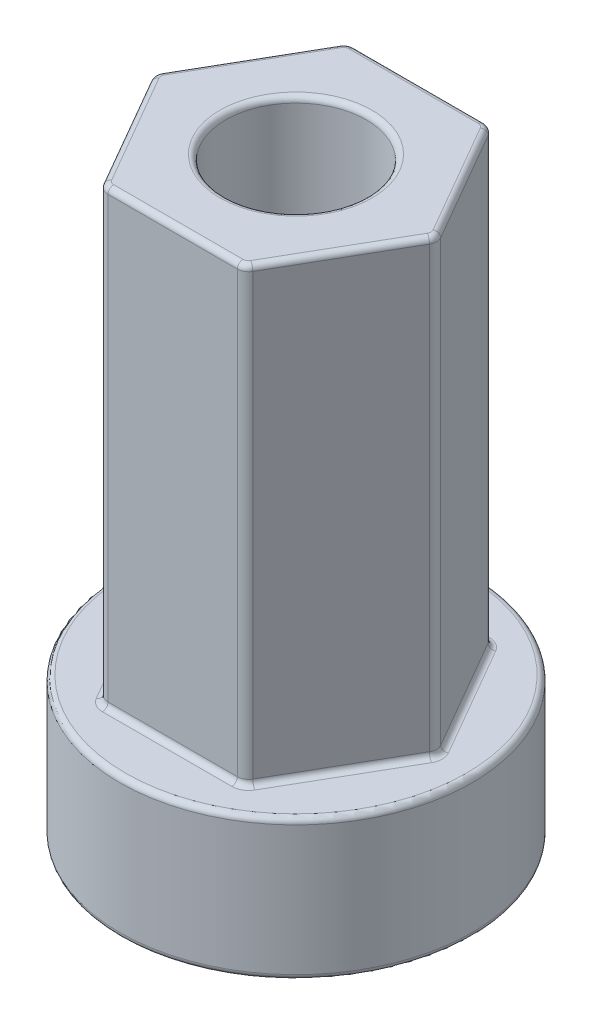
ISO-10303-21;
HEADER;
FILE_DESCRIPTION(('STEP AP214'),'2;1');
FILE_NAME('part.step','',(''),(''),'','','');
FILE_SCHEMA(('AUTOMOTIVE_DESIGN { 1 0 10303 214 1 1 1 1 }'));
ENDSEC;
DATA;
#1=APPLICATION_CONTEXT('core data for automotive mechanical design processes');
#2=APPLICATION_PROTOCOL_DEFINITION('international standard','automotive_design',2000,#1);
#3=PRODUCT_CONTEXT('',#1,'mechanical');
#4=PRODUCT('Part','Part','',(#3));
#5=PRODUCT_RELATED_PRODUCT_CATEGORY('part','',(#4));
#6=PRODUCT_DEFINITION_FORMATION('','',#4);
#7=PRODUCT_DEFINITION_CONTEXT('part definition',#1,'design');
#8=PRODUCT_DEFINITION('design','',#6,#7);
#9=PRODUCT_DEFINITION_SHAPE('','',#8);
#10=(LENGTH_UNIT() NAMED_UNIT(*) SI_UNIT(.MILLI.,.METRE.));
#11=(NAMED_UNIT(*) PLANE_ANGLE_UNIT() SI_UNIT($,.RADIAN.));
#12=(NAMED_UNIT(*) SI_UNIT($,.STERADIAN.) SOLID_ANGLE_UNIT());
#13=UNCERTAINTY_MEASURE_WITH_UNIT(LENGTH_MEASURE(1.E-05),#10,'distance_accuracy_value','');
#14=(GEOMETRIC_REPRESENTATION_CONTEXT(3) GLOBAL_UNCERTAINTY_ASSIGNED_CONTEXT((#13)) GLOBAL_UNIT_ASSIGNED_CONTEXT((#10,
#11,#12)) REPRESENTATION_CONTEXT('',''));
#15=CARTESIAN_POINT('',(0.,0.,0.));
#16=DIRECTION('',(0.,0.,1.));
#17=DIRECTION('',(1.,0.,0.));
#18=AXIS2_PLACEMENT_3D('',#15,#16,#17);
#19=CARTESIAN_POINT('',(0.,6.35,0.));
#20=DIRECTION('',(0.,1.,0.));
#21=DIRECTION('',(0.,0.,1.));
#22=AXIS2_PLACEMENT_3D('',#19,#20,#21);
#23=PLANE('',#22);
#24=DIRECTION('',(1.,0.,0.));
#25=VECTOR('',#24,1.);
#26=CARTESIAN_POINT('',(0.,6.35,5.81025));
#27=LINE('',#26,#25);
#28=CARTESIAN_POINT('',(2.91460849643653,6.35,5.81025));
#29=VERTEX_POINT('',#28);
#30=CARTESIAN_POINT('',(-2.91460849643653,6.35,5.81025));
#31=VERTEX_POINT('',#30);
#32=EDGE_CURVE('E34',#29,#31,#27,.F.);
#33=ORIENTED_EDGE('',*,*,#32,.T.);
#34=CARTESIAN_POINT('',(-2.91460849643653,6.35,5.04825));
#35=DIRECTION('',(0.,1.,0.));
#36=DIRECTION('',(0.,0.,1.));
#37=AXIS2_PLACEMENT_3D('',#34,#35,#36);
#38=CIRCLE('',#37,0.762);
#39=CARTESIAN_POINT('',(-3.57451985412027,6.35,5.42925));
#40=VERTEX_POINT('',#39);
#41=EDGE_CURVE('E11',#31,#40,#38,.F.);
#42=ORIENTED_EDGE('',*,*,#41,.T.);
#43=DIRECTION('',(0.5,0.,0.866025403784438));
#44=VECTOR('',#43,1.);
#45=CARTESIAN_POINT('',(-5.03182410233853,6.35,2.905125));
#46=LINE('',#45,#44);
#47=CARTESIAN_POINT('',(-6.4891283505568,6.35,0.381000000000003));
#48=VERTEX_POINT('',#47);
#49=EDGE_CURVE('E269',#40,#48,#46,.F.);
#50=ORIENTED_EDGE('',*,*,#49,.T.);
#51=CARTESIAN_POINT('',(-5.82921699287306,6.35,0.));
#52=DIRECTION('',(0.,1.,0.));
#53=DIRECTION('',(0.,0.,1.));
#54=AXIS2_PLACEMENT_3D('',#51,#52,#53);
#55=CIRCLE('',#54,0.762);
#56=CARTESIAN_POINT('',(-6.4891283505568,6.35,-0.380999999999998));
#57=VERTEX_POINT('',#56);
#58=EDGE_CURVE('E271',#48,#57,#55,.F.);
#59=ORIENTED_EDGE('',*,*,#58,.T.);
#60=DIRECTION('',(-0.5,0.,0.866025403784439));
#61=VECTOR('',#60,1.);
#62=CARTESIAN_POINT('',(-5.03182410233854,6.35,-2.905125));
#63=LINE('',#62,#61);
#64=CARTESIAN_POINT('',(-3.57451985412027,6.35,-5.42925));
#65=VERTEX_POINT('',#64);
#66=EDGE_CURVE('E273',#57,#65,#63,.F.);
#67=ORIENTED_EDGE('',*,*,#66,.T.);
#68=CARTESIAN_POINT('',(-2.91460849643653,6.35,-5.04825));
#69=DIRECTION('',(0.,1.,0.));
#70=DIRECTION('',(0.,0.,1.));
#71=AXIS2_PLACEMENT_3D('',#68,#69,#70);
#72=CIRCLE('',#71,0.762);
#73=CARTESIAN_POINT('',(-2.91460849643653,6.35,-5.81025));
#74=VERTEX_POINT('',#73);
#75=EDGE_CURVE('E275',#65,#74,#72,.F.);
#76=ORIENTED_EDGE('',*,*,#75,.T.);
#77=DIRECTION('',(-1.,0.,0.));
#78=VECTOR('',#77,1.);
#79=CARTESIAN_POINT('',(0.,6.35,-5.81025));
#80=LINE('',#79,#78);
#81=CARTESIAN_POINT('',(2.91460849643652,6.35,-5.81025));
#82=VERTEX_POINT('',#81);
#83=EDGE_CURVE('E277',#74,#82,#80,.F.);
#84=ORIENTED_EDGE('',*,*,#83,.T.);
#85=CARTESIAN_POINT('',(2.91460849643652,6.35,-5.04825));
#86=DIRECTION('',(0.,1.,0.));
#87=DIRECTION('',(0.,0.,1.));
#88=AXIS2_PLACEMENT_3D('',#85,#86,#87);
#89=CIRCLE('',#88,0.762);
#90=CARTESIAN_POINT('',(3.57451985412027,6.35,-5.42925));
#91=VERTEX_POINT('',#90);
#92=EDGE_CURVE('E279',#82,#91,#89,.F.);
#93=ORIENTED_EDGE('',*,*,#92,.T.);
#94=DIRECTION('',(-0.5,0.,-0.866025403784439));
#95=VECTOR('',#94,1.);
#96=CARTESIAN_POINT('',(5.03182410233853,6.35,-2.905125));
#97=LINE('',#96,#95);
#98=CARTESIAN_POINT('',(6.4891283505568,6.35,-0.381));
#99=VERTEX_POINT('',#98);
#100=EDGE_CURVE('E281',#91,#99,#97,.F.);
#101=ORIENTED_EDGE('',*,*,#100,.T.);
#102=CARTESIAN_POINT('',(5.82921699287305,6.35,0.));
#103=DIRECTION('',(0.,1.,0.));
#104=DIRECTION('',(0.,0.,1.));
#105=AXIS2_PLACEMENT_3D('',#102,#103,#104);
#106=CIRCLE('',#105,0.762);
#107=CARTESIAN_POINT('',(6.4891283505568,6.35,0.381));
#108=VERTEX_POINT('',#107);
#109=EDGE_CURVE('E283',#99,#108,#106,.F.);
#110=ORIENTED_EDGE('',*,*,#109,.T.);
#111=DIRECTION('',(0.5,0.,-0.866025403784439));
#112=VECTOR('',#111,1.);
#113=CARTESIAN_POINT('',(5.03182410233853,6.35,2.905125));
#114=LINE('',#113,#112);
#115=CARTESIAN_POINT('',(3.57451985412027,6.35,5.42925));
#116=VERTEX_POINT('',#115);
#117=EDGE_CURVE('E285',#108,#116,#114,.F.);
#118=ORIENTED_EDGE('',*,*,#117,.T.);
#119=CARTESIAN_POINT('',(2.91460849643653,6.35,5.04825));
#120=DIRECTION('',(0.,1.,0.));
#121=DIRECTION('',(0.,0.,1.));
#122=AXIS2_PLACEMENT_3D('',#119,#120,#121);
#123=CIRCLE('',#122,0.762);
#124=EDGE_CURVE('E44',#116,#29,#123,.F.);
#125=ORIENTED_EDGE('',*,*,#124,.T.);
#126=EDGE_LOOP('',(#33,#42,#50,#59,#67,#76,#84,#93,#101,#110,#118,#125));
#127=FACE_BOUND('',#126,.T.);
#128=CARTESIAN_POINT('',(0.,6.35,0.));
#129=DIRECTION('',(0.,1.,0.));
#130=DIRECTION('',(0.,0.,1.));
#131=AXIS2_PLACEMENT_3D('',#128,#129,#130);
#132=CIRCLE('',#131,7.6835);
#133=CARTESIAN_POINT('',(0.,6.35,7.6835));
#134=VERTEX_POINT('',#133);
#135=EDGE_CURVE('E266',#134,#134,#132,.T.);
#136=ORIENTED_EDGE('',*,*,#135,.T.);
#137=EDGE_LOOP('',(#136));
#138=FACE_BOUND('',#137,.T.);
#139=ADVANCED_FACE('F26',(#127,#138),#23,.T.);
#140=CARTESIAN_POINT('',(0.,6.35,0.));
#141=DIRECTION('',(0.,-1.,0.));
#142=DIRECTION('',(0.,0.,-1.));
#143=AXIS2_PLACEMENT_3D('',#140,#141,#142);
#144=CYLINDRICAL_SURFACE('',#143,7.9375);
#145=CARTESIAN_POINT('',(0.,0.254,0.));
#146=DIRECTION('',(0.,1.,0.));
#147=DIRECTION('',(0.,0.,1.));
#148=AXIS2_PLACEMENT_3D('',#145,#146,#147);
#149=CIRCLE('',#148,7.9375);
#150=CARTESIAN_POINT('',(0.,0.254,7.9375));
#151=VERTEX_POINT('',#150);
#152=EDGE_CURVE('E419',#151,#151,#149,.T.);
#153=ORIENTED_EDGE('',*,*,#152,.T.);
#154=EDGE_LOOP('',(#153));
#155=FACE_BOUND('',#154,.T.);
#156=CARTESIAN_POINT('',(0.,6.096,0.));
#157=DIRECTION('',(0.,1.,0.));
#158=DIRECTION('',(0.,0.,1.));
#159=AXIS2_PLACEMENT_3D('',#156,#157,#158);
#160=CIRCLE('',#159,7.9375);
#161=CARTESIAN_POINT('',(0.,6.096,7.9375));
#162=VERTEX_POINT('',#161);
#163=EDGE_CURVE('E416',#162,#162,#160,.F.);
#164=ORIENTED_EDGE('',*,*,#163,.T.);
#165=EDGE_LOOP('',(#164));
#166=FACE_BOUND('',#165,.T.);
#167=ADVANCED_FACE('F28',(#155,#166),#144,.T.);
#168=CARTESIAN_POINT('',(0.,0.,0.));
#169=DIRECTION('',(0.,1.,0.));
#170=DIRECTION('',(0.,0.,1.));
#171=AXIS2_PLACEMENT_3D('',#168,#169,#170);
#172=PLANE('',#171);
#173=CARTESIAN_POINT('',(0.,0.,0.));
#174=DIRECTION('',(0.,1.,0.));
#175=DIRECTION('',(0.,0.,1.));
#176=AXIS2_PLACEMENT_3D('',#173,#174,#175);
#177=CIRCLE('',#176,7.6835);
#178=CARTESIAN_POINT('',(0.,0.,7.6835));
#179=VERTEX_POINT('',#178);
#180=EDGE_CURVE('E425',#179,#179,#177,.F.);
#181=ORIENTED_EDGE('',*,*,#180,.T.);
#182=EDGE_LOOP('',(#181));
#183=FACE_BOUND('',#182,.T.);
#184=CARTESIAN_POINT('',(0.,0.,0.));
#185=DIRECTION('',(0.,1.,0.));
#186=DIRECTION('',(0.,0.,1.));
#187=AXIS2_PLACEMENT_3D('',#184,#185,#186);
#188=CIRCLE('',#187,3.429);
#189=CARTESIAN_POINT('',(0.,0.,3.429));
#190=VERTEX_POINT('',#189);
#191=EDGE_CURVE('E422',#190,#190,#188,.T.);
#192=ORIENTED_EDGE('',*,*,#191,.T.);
#193=EDGE_LOOP('',(#192));
#194=FACE_BOUND('',#193,.T.);
#195=ADVANCED_FACE('F572',(#183,#194),#172,.F.);
#196=CARTESIAN_POINT('',(-3.20790243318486,26.67,-5.55625));
#197=DIRECTION('',(0.866025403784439,0.,0.5));
#198=DIRECTION('',(0.5,0.,-0.866025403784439));
#199=AXIS2_PLACEMENT_3D('',#196,#197,#198);
#200=PLANE('',#199);
#201=DIRECTION('',(0.,-1.,0.));
#202=VECTOR('',#201,1.);
#203=CARTESIAN_POINT('',(-6.26915789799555,26.67,-0.253999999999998));
#204=LINE('',#203,#202);
#205=CARTESIAN_POINT('',(-6.26915789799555,6.604,-0.253999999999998));
#206=VERTEX_POINT('',#205);
#207=CARTESIAN_POINT('',(-6.26915789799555,26.416,-0.253999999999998));
#208=VERTEX_POINT('',#207);
#209=EDGE_CURVE('E380',#206,#208,#204,.F.);
#210=ORIENTED_EDGE('',*,*,#209,.T.);
#211=DIRECTION('',(-0.5,0.,0.866025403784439));
#212=VECTOR('',#211,1.);
#213=CARTESIAN_POINT('',(-3.35454940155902,26.416,-5.30225));
#214=LINE('',#213,#212);
#215=CARTESIAN_POINT('',(-3.35454940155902,26.416,-5.30225));
#216=VERTEX_POINT('',#215);
#217=EDGE_CURVE('E256',#208,#216,#214,.F.);
#218=ORIENTED_EDGE('',*,*,#217,.T.);
#219=DIRECTION('',(0.,-1.,0.));
#220=VECTOR('',#219,1.);
#221=CARTESIAN_POINT('',(-3.35454940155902,26.67,-5.30225));
#222=LINE('',#221,#220);
#223=CARTESIAN_POINT('',(-3.35454940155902,6.604,-5.30225));
#224=VERTEX_POINT('',#223);
#225=EDGE_CURVE('E383',#216,#224,#222,.T.);
#226=ORIENTED_EDGE('',*,*,#225,.T.);
#227=DIRECTION('',(-0.5,0.,0.866025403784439));
#228=VECTOR('',#227,1.);
#229=CARTESIAN_POINT('',(-3.20790243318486,6.604,-5.55625));
#230=LINE('',#229,#228);
#231=EDGE_CURVE('E254',#224,#206,#230,.T.);
#232=ORIENTED_EDGE('',*,*,#231,.T.);
#233=EDGE_LOOP('',(#210,#218,#226,#232));
#234=FACE_BOUND('',#233,.T.);
#235=ADVANCED_FACE('F535',(#234),#200,.F.);
#236=CARTESIAN_POINT('',(-6.41580486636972,26.67,0.));
#237=DIRECTION('',(0.866025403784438,0.,-0.5));
#238=DIRECTION('',(-0.5,0.,-0.866025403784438));
#239=AXIS2_PLACEMENT_3D('',#236,#237,#238);
#240=PLANE('',#239);
#241=DIRECTION('',(0.,-1.,0.));
#242=VECTOR('',#241,1.);
#243=CARTESIAN_POINT('',(-3.35454940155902,26.67,5.30225));
#244=LINE('',#243,#242);
#245=CARTESIAN_POINT('',(-3.35454940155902,6.604,5.30225));
#246=VERTEX_POINT('',#245);
#247=CARTESIAN_POINT('',(-3.35454940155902,26.416,5.30225));
#248=VERTEX_POINT('',#247);
#249=EDGE_CURVE('E413',#246,#248,#244,.F.);
#250=ORIENTED_EDGE('',*,*,#249,.T.);
#251=DIRECTION('',(0.5,0.,0.866025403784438));
#252=VECTOR('',#251,1.);
#253=CARTESIAN_POINT('',(-6.26915789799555,26.416,0.254000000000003));
#254=LINE('',#253,#252);
#255=CARTESIAN_POINT('',(-6.26915789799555,26.416,0.254000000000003));
#256=VERTEX_POINT('',#255);
#257=EDGE_CURVE('E248',#248,#256,#254,.F.);
#258=ORIENTED_EDGE('',*,*,#257,.T.);
#259=DIRECTION('',(0.,-1.,0.));
#260=VECTOR('',#259,1.);
#261=CARTESIAN_POINT('',(-6.26915789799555,26.67,0.254000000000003));
#262=LINE('',#261,#260);
#263=CARTESIAN_POINT('',(-6.26915789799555,6.604,0.254000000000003));
#264=VERTEX_POINT('',#263);
#265=EDGE_CURVE('E410',#256,#264,#262,.T.);
#266=ORIENTED_EDGE('',*,*,#265,.T.);
#267=DIRECTION('',(0.5,0.,0.866025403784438));
#268=VECTOR('',#267,1.);
#269=CARTESIAN_POINT('',(-6.41580486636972,6.604,0.));
#270=LINE('',#269,#268);
#271=EDGE_CURVE('E246',#264,#246,#270,.T.);
#272=ORIENTED_EDGE('',*,*,#271,.T.);
#273=EDGE_LOOP('',(#250,#258,#266,#272));
#274=FACE_BOUND('',#273,.T.);
#275=ADVANCED_FACE('F513',(#274),#240,.F.);
#276=CARTESIAN_POINT('',(-3.20790243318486,26.67,5.55625));
#277=DIRECTION('',(0.,0.,-1.));
#278=DIRECTION('',(-1.,0.,0.));
#279=AXIS2_PLACEMENT_3D('',#276,#277,#278);
#280=PLANE('',#279);
#281=DIRECTION('',(0.,-1.,0.));
#282=VECTOR('',#281,1.);
#283=CARTESIAN_POINT('',(2.91460849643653,26.67,5.55625));
#284=LINE('',#283,#282);
#285=CARTESIAN_POINT('',(2.91460849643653,6.604,5.55625));
#286=VERTEX_POINT('',#285);
#287=CARTESIAN_POINT('',(2.91460849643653,26.416,5.55625));
#288=VERTEX_POINT('',#287);
#289=EDGE_CURVE('E407',#286,#288,#284,.F.);
#290=ORIENTED_EDGE('',*,*,#289,.T.);
#291=DIRECTION('',(1.,0.,0.));
#292=VECTOR('',#291,1.);
#293=CARTESIAN_POINT('',(-2.91460849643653,26.416,5.55625));
#294=LINE('',#293,#292);
#295=CARTESIAN_POINT('',(-2.91460849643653,26.416,5.55625));
#296=VERTEX_POINT('',#295);
#297=EDGE_CURVE('E239',#288,#296,#294,.F.);
#298=ORIENTED_EDGE('',*,*,#297,.T.);
#299=DIRECTION('',(0.,-1.,0.));
#300=VECTOR('',#299,1.);
#301=CARTESIAN_POINT('',(-2.91460849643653,26.67,5.55625));
#302=LINE('',#301,#300);
#303=CARTESIAN_POINT('',(-2.91460849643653,6.604,5.55625));
#304=VERTEX_POINT('',#303);
#305=EDGE_CURVE('E404',#296,#304,#302,.T.);
#306=ORIENTED_EDGE('',*,*,#305,.T.);
#307=DIRECTION('',(1.,0.,0.));
#308=VECTOR('',#307,1.);
#309=CARTESIAN_POINT('',(-3.20790243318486,6.604,5.55625));
#310=LINE('',#309,#308);
#311=EDGE_CURVE('E237',#304,#286,#310,.T.);
#312=ORIENTED_EDGE('',*,*,#311,.T.);
#313=EDGE_LOOP('',(#290,#298,#306,#312));
#314=FACE_BOUND('',#313,.T.);
#315=ADVANCED_FACE('F497',(#314),#280,.F.);
#316=CARTESIAN_POINT('',(3.20790243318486,26.67,5.55625));
#317=DIRECTION('',(-0.866025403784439,0.,-0.5));
#318=DIRECTION('',(-0.5,0.,0.866025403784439));
#319=AXIS2_PLACEMENT_3D('',#316,#317,#318);
#320=PLANE('',#319);
#321=DIRECTION('',(0.,-1.,0.));
#322=VECTOR('',#321,1.);
#323=CARTESIAN_POINT('',(6.26915789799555,26.67,0.254));
#324=LINE('',#323,#322);
#325=CARTESIAN_POINT('',(6.26915789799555,6.604,0.254));
#326=VERTEX_POINT('',#325);
#327=CARTESIAN_POINT('',(6.26915789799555,26.416,0.254));
#328=VERTEX_POINT('',#327);
#329=EDGE_CURVE('E401',#326,#328,#324,.F.);
#330=ORIENTED_EDGE('',*,*,#329,.T.);
#331=DIRECTION('',(0.5,0.,-0.866025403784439));
#332=VECTOR('',#331,1.);
#333=CARTESIAN_POINT('',(3.35454940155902,26.416,5.30225));
#334=LINE('',#333,#332);
#335=CARTESIAN_POINT('',(3.35454940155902,26.416,5.30225));
#336=VERTEX_POINT('',#335);
#337=EDGE_CURVE('E231',#328,#336,#334,.F.);
#338=ORIENTED_EDGE('',*,*,#337,.T.);
#339=DIRECTION('',(0.,-1.,0.));
#340=VECTOR('',#339,1.);
#341=CARTESIAN_POINT('',(3.35454940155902,26.67,5.30225));
#342=LINE('',#341,#340);
#343=CARTESIAN_POINT('',(3.35454940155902,6.604,5.30225));
#344=VERTEX_POINT('',#343);
#345=EDGE_CURVE('E398',#336,#344,#342,.T.);
#346=ORIENTED_EDGE('',*,*,#345,.T.);
#347=DIRECTION('',(0.5,0.,-0.866025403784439));
#348=VECTOR('',#347,1.);
#349=CARTESIAN_POINT('',(3.20790243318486,6.604,5.55625));
#350=LINE('',#349,#348);
#351=EDGE_CURVE('E229',#344,#326,#350,.T.);
#352=ORIENTED_EDGE('',*,*,#351,.T.);
#353=EDGE_LOOP('',(#330,#338,#346,#352));
#354=FACE_BOUND('',#353,.T.);
#355=ADVANCED_FACE('F482',(#354),#320,.F.);
#356=CARTESIAN_POINT('',(6.41580486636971,26.67,0.));
#357=DIRECTION('',(-0.866025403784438,0.,0.5));
#358=DIRECTION('',(0.5,0.,0.866025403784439));
#359=AXIS2_PLACEMENT_3D('',#356,#357,#358);
#360=PLANE('',#359);
#361=DIRECTION('',(0.,-1.,0.));
#362=VECTOR('',#361,1.);
#363=CARTESIAN_POINT('',(3.35454940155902,26.67,-5.30225));
#364=LINE('',#363,#362);
#365=CARTESIAN_POINT('',(3.35454940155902,6.604,-5.30225));
#366=VERTEX_POINT('',#365);
#367=CARTESIAN_POINT('',(3.35454940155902,26.416,-5.30225));
#368=VERTEX_POINT('',#367);
#369=EDGE_CURVE('E395',#366,#368,#364,.F.);
#370=ORIENTED_EDGE('',*,*,#369,.T.);
#371=DIRECTION('',(-0.5,0.,-0.866025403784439));
#372=VECTOR('',#371,1.);
#373=CARTESIAN_POINT('',(6.26915789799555,26.416,-0.253999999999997));
#374=LINE('',#373,#372);
#375=CARTESIAN_POINT('',(6.26915789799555,26.416,-0.254));
#376=VERTEX_POINT('',#375);
#377=EDGE_CURVE('E223',#368,#376,#374,.F.);
#378=ORIENTED_EDGE('',*,*,#377,.T.);
#379=DIRECTION('',(0.,-1.,0.));
#380=VECTOR('',#379,1.);
#381=CARTESIAN_POINT('',(6.26915789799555,26.67,-0.254));
#382=LINE('',#381,#380);
#383=CARTESIAN_POINT('',(6.26915789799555,6.604,-0.254));
#384=VERTEX_POINT('',#383);
#385=EDGE_CURVE('E392',#376,#384,#382,.T.);
#386=ORIENTED_EDGE('',*,*,#385,.T.);
#387=DIRECTION('',(-0.5,0.,-0.866025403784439));
#388=VECTOR('',#387,1.);
#389=CARTESIAN_POINT('',(6.41580486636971,6.604,0.));
#390=LINE('',#389,#388);
#391=EDGE_CURVE('E221',#384,#366,#390,.T.);
#392=ORIENTED_EDGE('',*,*,#391,.T.);
#393=EDGE_LOOP('',(#370,#378,#386,#392));
#394=FACE_BOUND('',#393,.T.);
#395=ADVANCED_FACE('F467',(#394),#360,.F.);
#396=CARTESIAN_POINT('',(3.20790243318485,26.67,-5.55625));
#397=DIRECTION('',(0.,0.,1.));
#398=DIRECTION('',(1.,0.,0.));
#399=AXIS2_PLACEMENT_3D('',#396,#397,#398);
#400=PLANE('',#399);
#401=DIRECTION('',(0.,-1.,0.));
#402=VECTOR('',#401,1.);
#403=CARTESIAN_POINT('',(-2.91460849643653,26.67,-5.55625));
#404=LINE('',#403,#402);
#405=CARTESIAN_POINT('',(-2.91460849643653,6.604,-5.55625));
#406=VERTEX_POINT('',#405);
#407=CARTESIAN_POINT('',(-2.91460849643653,26.416,-5.55625));
#408=VERTEX_POINT('',#407);
#409=EDGE_CURVE('E389',#406,#408,#404,.F.);
#410=ORIENTED_EDGE('',*,*,#409,.T.);
#411=DIRECTION('',(-1.,0.,0.));
#412=VECTOR('',#411,1.);
#413=CARTESIAN_POINT('',(2.91460849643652,26.416,-5.55625));
#414=LINE('',#413,#412);
#415=CARTESIAN_POINT('',(2.91460849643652,26.416,-5.55625));
#416=VERTEX_POINT('',#415);
#417=EDGE_CURVE('E264',#408,#416,#414,.F.);
#418=ORIENTED_EDGE('',*,*,#417,.T.);
#419=DIRECTION('',(0.,-1.,0.));
#420=VECTOR('',#419,1.);
#421=CARTESIAN_POINT('',(2.91460849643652,26.67,-5.55625));
#422=LINE('',#421,#420);
#423=CARTESIAN_POINT('',(2.91460849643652,6.604,-5.55625));
#424=VERTEX_POINT('',#423);
#425=EDGE_CURVE('E386',#416,#424,#422,.T.);
#426=ORIENTED_EDGE('',*,*,#425,.T.);
#427=DIRECTION('',(-1.,0.,0.));
#428=VECTOR('',#427,1.);
#429=CARTESIAN_POINT('',(3.20790243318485,6.604,-5.55625));
#430=LINE('',#429,#428);
#431=EDGE_CURVE('E262',#424,#406,#430,.T.);
#432=ORIENTED_EDGE('',*,*,#431,.T.);
#433=EDGE_LOOP('',(#410,#418,#426,#432));
#434=FACE_BOUND('',#433,.T.);
#435=ADVANCED_FACE('F557',(#434),#400,.F.);
#436=CARTESIAN_POINT('',(-6.41580486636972,26.67,0.));
#437=DIRECTION('',(0.,1.,0.));
#438=DIRECTION('',(0.,0.,1.));
#439=AXIS2_PLACEMENT_3D('',#436,#437,#438);
#440=PLANE('',#439);
#441=DIRECTION('',(-0.5,0.,-0.866025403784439));
#442=VECTOR('',#441,1.);
#443=CARTESIAN_POINT('',(3.13457894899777,26.67,-5.17525));
#444=LINE('',#443,#442);
#445=CARTESIAN_POINT('',(6.0491874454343,26.67,-0.127));
#446=VERTEX_POINT('',#445);
#447=CARTESIAN_POINT('',(3.13457894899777,26.67,-5.17525));
#448=VERTEX_POINT('',#447);
#449=EDGE_CURVE('E211',#446,#448,#444,.T.);
#450=ORIENTED_EDGE('',*,*,#449,.T.);
#451=CARTESIAN_POINT('',(2.91460849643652,26.67,-5.04825));
#452=DIRECTION('',(0.,1.,0.));
#453=DIRECTION('',(0.,0.,1.));
#454=AXIS2_PLACEMENT_3D('',#451,#452,#453);
#455=CIRCLE('',#454,0.254);
#456=CARTESIAN_POINT('',(2.91460849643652,26.67,-5.30225));
#457=VERTEX_POINT('',#456);
#458=EDGE_CURVE('E190',#448,#457,#455,.T.);
#459=ORIENTED_EDGE('',*,*,#458,.T.);
#460=DIRECTION('',(-1.,0.,0.));
#461=VECTOR('',#460,1.);
#462=CARTESIAN_POINT('',(-2.91460849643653,26.67,-5.30225));
#463=LINE('',#462,#461);
#464=CARTESIAN_POINT('',(-2.91460849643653,26.67,-5.30225));
#465=VERTEX_POINT('',#464);
#466=EDGE_CURVE('E199',#457,#465,#463,.T.);
#467=ORIENTED_EDGE('',*,*,#466,.T.);
#468=CARTESIAN_POINT('',(-2.91460849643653,26.67,-5.04825));
#469=DIRECTION('',(0.,1.,0.));
#470=DIRECTION('',(0.,0.,1.));
#471=AXIS2_PLACEMENT_3D('',#468,#469,#470);
#472=CIRCLE('',#471,0.254);
#473=CARTESIAN_POINT('',(-3.13457894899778,26.67,-5.17525));
#474=VERTEX_POINT('',#473);
#475=EDGE_CURVE('E205',#465,#474,#472,.T.);
#476=ORIENTED_EDGE('',*,*,#475,.T.);
#477=DIRECTION('',(-0.5,0.,0.866025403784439));
#478=VECTOR('',#477,1.);
#479=CARTESIAN_POINT('',(-6.04918744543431,26.67,-0.126999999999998));
#480=LINE('',#479,#478);
#481=CARTESIAN_POINT('',(-6.04918744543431,26.67,-0.126999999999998));
#482=VERTEX_POINT('',#481);
#483=EDGE_CURVE('E437',#474,#482,#480,.T.);
#484=ORIENTED_EDGE('',*,*,#483,.T.);
#485=CARTESIAN_POINT('',(-5.82921699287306,26.67,0.));
#486=DIRECTION('',(0.,1.,0.));
#487=DIRECTION('',(0.,0.,1.));
#488=AXIS2_PLACEMENT_3D('',#485,#486,#487);
#489=CIRCLE('',#488,0.254);
#490=CARTESIAN_POINT('',(-6.0491874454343,26.67,0.127000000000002));
#491=VERTEX_POINT('',#490);
#492=EDGE_CURVE('E439',#482,#491,#489,.T.);
#493=ORIENTED_EDGE('',*,*,#492,.T.);
#494=DIRECTION('',(0.5,0.,0.866025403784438));
#495=VECTOR('',#494,1.);
#496=CARTESIAN_POINT('',(-3.13457894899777,26.67,5.17525));
#497=LINE('',#496,#495);
#498=CARTESIAN_POINT('',(-3.13457894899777,26.67,5.17525));
#499=VERTEX_POINT('',#498);
#500=EDGE_CURVE('E441',#491,#499,#497,.T.);
#501=ORIENTED_EDGE('',*,*,#500,.T.);
#502=CARTESIAN_POINT('',(-2.91460849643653,26.67,5.04825));
#503=DIRECTION('',(0.,1.,0.));
#504=DIRECTION('',(0.,0.,1.));
#505=AXIS2_PLACEMENT_3D('',#502,#503,#504);
#506=CIRCLE('',#505,0.254);
#507=CARTESIAN_POINT('',(-2.91460849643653,26.67,5.30225));
#508=VERTEX_POINT('',#507);
#509=EDGE_CURVE('E443',#499,#508,#506,.T.);
#510=ORIENTED_EDGE('',*,*,#509,.T.);
#511=DIRECTION('',(1.,0.,0.));
#512=VECTOR('',#511,1.);
#513=CARTESIAN_POINT('',(2.91460849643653,26.67,5.30225));
#514=LINE('',#513,#512);
#515=CARTESIAN_POINT('',(2.91460849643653,26.67,5.30225));
#516=VERTEX_POINT('',#515);
#517=EDGE_CURVE('E445',#508,#516,#514,.T.);
#518=ORIENTED_EDGE('',*,*,#517,.T.);
#519=CARTESIAN_POINT('',(2.91460849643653,26.67,5.04825));
#520=DIRECTION('',(0.,1.,0.));
#521=DIRECTION('',(0.,0.,1.));
#522=AXIS2_PLACEMENT_3D('',#519,#520,#521);
#523=CIRCLE('',#522,0.254);
#524=CARTESIAN_POINT('',(3.13457894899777,26.67,5.17525));
#525=VERTEX_POINT('',#524);
#526=EDGE_CURVE('E447',#516,#525,#523,.T.);
#527=ORIENTED_EDGE('',*,*,#526,.T.);
#528=DIRECTION('',(0.5,0.,-0.866025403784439));
#529=VECTOR('',#528,1.);
#530=CARTESIAN_POINT('',(6.0491874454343,26.67,0.126999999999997));
#531=LINE('',#530,#529);
#532=CARTESIAN_POINT('',(6.0491874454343,26.67,0.126999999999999));
#533=VERTEX_POINT('',#532);
#534=EDGE_CURVE('E449',#525,#533,#531,.T.);
#535=ORIENTED_EDGE('',*,*,#534,.T.);
#536=CARTESIAN_POINT('',(5.82921699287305,26.67,0.));
#537=DIRECTION('',(0.,1.,0.));
#538=DIRECTION('',(0.,0.,1.));
#539=AXIS2_PLACEMENT_3D('',#536,#537,#538);
#540=CIRCLE('',#539,0.254);
#541=EDGE_CURVE('E216',#533,#446,#540,.T.);
#542=ORIENTED_EDGE('',*,*,#541,.T.);
#543=EDGE_LOOP('',(#450,#459,#467,#476,#484,#493,#501,#510,#518,#527,#535,#542));
#544=FACE_BOUND('',#543,.T.);
#545=CARTESIAN_POINT('',(0.,26.67,0.));
#546=DIRECTION('',(0.,1.,0.));
#547=DIRECTION('',(0.,0.,1.));
#548=AXIS2_PLACEMENT_3D('',#545,#546,#547);
#549=CIRCLE('',#548,3.429);
#550=CARTESIAN_POINT('',(0.,26.67,3.429));
#551=VERTEX_POINT('',#550);
#552=EDGE_CURVE('E206',#551,#551,#549,.F.);
#553=ORIENTED_EDGE('',*,*,#552,.T.);
#554=EDGE_LOOP('',(#553));
#555=FACE_BOUND('',#554,.T.);
#556=ADVANCED_FACE('F208',(#544,#555),#440,.T.);
#557=CARTESIAN_POINT('',(0.,0.,0.));
#558=DIRECTION('',(0.,1.,0.));
#559=DIRECTION('',(0.,0.,1.));
#560=AXIS2_PLACEMENT_3D('',#557,#558,#559);
#561=CYLINDRICAL_SURFACE('',#560,3.175);
#562=CARTESIAN_POINT('',(0.,0.254,0.));
#563=DIRECTION('',(0.,1.,0.));
#564=DIRECTION('',(0.,0.,1.));
#565=AXIS2_PLACEMENT_3D('',#562,#563,#564);
#566=CIRCLE('',#565,3.175);
#567=CARTESIAN_POINT('',(0.,0.254,3.175));
#568=VERTEX_POINT('',#567);
#569=EDGE_CURVE('E431',#568,#568,#566,.F.);
#570=ORIENTED_EDGE('',*,*,#569,.T.);
#571=EDGE_LOOP('',(#570));
#572=FACE_BOUND('',#571,.T.);
#573=CARTESIAN_POINT('',(0.,26.416,0.));
#574=DIRECTION('',(0.,1.,0.));
#575=DIRECTION('',(0.,0.,1.));
#576=AXIS2_PLACEMENT_3D('',#573,#574,#575);
#577=CIRCLE('',#576,3.175);
#578=CARTESIAN_POINT('',(0.,26.416,3.175));
#579=VERTEX_POINT('',#578);
#580=EDGE_CURVE('E428',#579,#579,#577,.T.);
#581=ORIENTED_EDGE('',*,*,#580,.T.);
#582=EDGE_LOOP('',(#581));
#583=FACE_BOUND('',#582,.T.);
#584=ADVANCED_FACE('F592',(#572,#583),#561,.F.);
#585=CARTESIAN_POINT('',(-2.91460849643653,26.67,-5.04825));
#586=DIRECTION('',(0.,-1.,0.));
#587=DIRECTION('',(0.,0.,-1.));
#588=AXIS2_PLACEMENT_3D('',#585,#586,#587);
#589=CYLINDRICAL_SURFACE('',#588,0.508);
#590=ORIENTED_EDGE('',*,*,#225,.F.);
#591=CARTESIAN_POINT('',(-2.91460849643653,26.416,-5.04825));
#592=DIRECTION('',(0.,1.,0.));
#593=DIRECTION('',(0.,0.,1.));
#594=AXIS2_PLACEMENT_3D('',#591,#592,#593);
#595=CIRCLE('',#594,0.508);
#596=EDGE_CURVE('E260',#216,#408,#595,.F.);
#597=ORIENTED_EDGE('',*,*,#596,.T.);
#598=ORIENTED_EDGE('',*,*,#409,.F.);
#599=CARTESIAN_POINT('',(-2.91460849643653,6.604,-5.04825));
#600=DIRECTION('',(0.,1.,0.));
#601=DIRECTION('',(0.,0.,1.));
#602=AXIS2_PLACEMENT_3D('',#599,#600,#601);
#603=CIRCLE('',#602,0.508);
#604=EDGE_CURVE('E258',#406,#224,#603,.T.);
#605=ORIENTED_EDGE('',*,*,#604,.T.);
#606=EDGE_LOOP('',(#590,#597,#598,#605));
#607=FACE_BOUND('',#606,.T.);
#608=ADVANCED_FACE('F538',(#607),#589,.T.);
#609=CARTESIAN_POINT('',(2.91460849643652,26.67,-5.04825));
#610=DIRECTION('',(0.,-1.,0.));
#611=DIRECTION('',(0.,0.,-1.));
#612=AXIS2_PLACEMENT_3D('',#609,#610,#611);
#613=CYLINDRICAL_SURFACE('',#612,0.508);
#614=ORIENTED_EDGE('',*,*,#425,.F.);
#615=CARTESIAN_POINT('',(2.91460849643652,26.416,-5.04825));
#616=DIRECTION('',(0.,1.,0.));
#617=DIRECTION('',(0.,0.,1.));
#618=AXIS2_PLACEMENT_3D('',#615,#616,#617);
#619=CIRCLE('',#618,0.508);
#620=EDGE_CURVE('E192',#416,#368,#619,.F.);
#621=ORIENTED_EDGE('',*,*,#620,.T.);
#622=ORIENTED_EDGE('',*,*,#369,.F.);
#623=CARTESIAN_POINT('',(2.91460849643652,6.604,-5.04825));
#624=DIRECTION('',(0.,1.,0.));
#625=DIRECTION('',(0.,0.,1.));
#626=AXIS2_PLACEMENT_3D('',#623,#624,#625);
#627=CIRCLE('',#626,0.508);
#628=EDGE_CURVE('E213',#366,#424,#627,.T.);
#629=ORIENTED_EDGE('',*,*,#628,.T.);
#630=EDGE_LOOP('',(#614,#621,#622,#629));
#631=FACE_BOUND('',#630,.T.);
#632=ADVANCED_FACE('F465',(#631),#613,.T.);
#633=CARTESIAN_POINT('',(5.82921699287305,26.67,0.));
#634=DIRECTION('',(0.,-1.,0.));
#635=DIRECTION('',(0.,0.,-1.));
#636=AXIS2_PLACEMENT_3D('',#633,#634,#635);
#637=CYLINDRICAL_SURFACE('',#636,0.508);
#638=ORIENTED_EDGE('',*,*,#385,.F.);
#639=CARTESIAN_POINT('',(5.82921699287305,26.416,0.));
#640=DIRECTION('',(0.,1.,0.));
#641=DIRECTION('',(0.,0.,1.));
#642=AXIS2_PLACEMENT_3D('',#639,#640,#641);
#643=CIRCLE('',#642,0.508);
#644=EDGE_CURVE('E227',#376,#328,#643,.F.);
#645=ORIENTED_EDGE('',*,*,#644,.T.);
#646=ORIENTED_EDGE('',*,*,#329,.F.);
#647=CARTESIAN_POINT('',(5.82921699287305,6.604,0.));
#648=DIRECTION('',(0.,1.,0.));
#649=DIRECTION('',(0.,0.,1.));
#650=AXIS2_PLACEMENT_3D('',#647,#648,#649);
#651=CIRCLE('',#650,0.508);
#652=EDGE_CURVE('E225',#326,#384,#651,.T.);
#653=ORIENTED_EDGE('',*,*,#652,.T.);
#654=EDGE_LOOP('',(#638,#645,#646,#653));
#655=FACE_BOUND('',#654,.T.);
#656=ADVANCED_FACE('F479',(#655),#637,.T.);
#657=CARTESIAN_POINT('',(2.91460849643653,26.67,5.04825));
#658=DIRECTION('',(0.,-1.,0.));
#659=DIRECTION('',(0.,0.,-1.));
#660=AXIS2_PLACEMENT_3D('',#657,#658,#659);
#661=CYLINDRICAL_SURFACE('',#660,0.508);
#662=ORIENTED_EDGE('',*,*,#345,.F.);
#663=CARTESIAN_POINT('',(2.91460849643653,26.416,5.04825));
#664=DIRECTION('',(0.,1.,0.));
#665=DIRECTION('',(0.,0.,1.));
#666=AXIS2_PLACEMENT_3D('',#663,#664,#665);
#667=CIRCLE('',#666,0.508);
#668=EDGE_CURVE('E235',#336,#288,#667,.F.);
#669=ORIENTED_EDGE('',*,*,#668,.T.);
#670=ORIENTED_EDGE('',*,*,#289,.F.);
#671=CARTESIAN_POINT('',(2.91460849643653,6.604,5.04825));
#672=DIRECTION('',(0.,1.,0.));
#673=DIRECTION('',(0.,0.,1.));
#674=AXIS2_PLACEMENT_3D('',#671,#672,#673);
#675=CIRCLE('',#674,0.508);
#676=EDGE_CURVE('E233',#286,#344,#675,.T.);
#677=ORIENTED_EDGE('',*,*,#676,.T.);
#678=EDGE_LOOP('',(#662,#669,#670,#677));
#679=FACE_BOUND('',#678,.T.);
#680=ADVANCED_FACE('F494',(#679),#661,.T.);
#681=CARTESIAN_POINT('',(-2.91460849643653,26.67,5.04825));
#682=DIRECTION('',(0.,-1.,0.));
#683=DIRECTION('',(0.,0.,-1.));
#684=AXIS2_PLACEMENT_3D('',#681,#682,#683);
#685=CYLINDRICAL_SURFACE('',#684,0.508);
#686=ORIENTED_EDGE('',*,*,#305,.F.);
#687=CARTESIAN_POINT('',(-2.91460849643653,26.416,5.04825));
#688=DIRECTION('',(0.,1.,0.));
#689=DIRECTION('',(0.,0.,1.));
#690=AXIS2_PLACEMENT_3D('',#687,#688,#689);
#691=CIRCLE('',#690,0.508);
#692=EDGE_CURVE('E244',#296,#248,#691,.F.);
#693=ORIENTED_EDGE('',*,*,#692,.T.);
#694=ORIENTED_EDGE('',*,*,#249,.F.);
#695=CARTESIAN_POINT('',(-2.91460849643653,6.604,5.04825));
#696=DIRECTION('',(0.,1.,0.));
#697=DIRECTION('',(0.,0.,1.));
#698=AXIS2_PLACEMENT_3D('',#695,#696,#697);
#699=CIRCLE('',#698,0.508);
#700=EDGE_CURVE('E241',#246,#304,#699,.T.);
#701=ORIENTED_EDGE('',*,*,#700,.T.);
#702=EDGE_LOOP('',(#686,#693,#694,#701));
#703=FACE_BOUND('',#702,.T.);
#704=ADVANCED_FACE('F511',(#703),#685,.T.);
#705=CARTESIAN_POINT('',(-5.82921699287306,26.67,0.));
#706=DIRECTION('',(0.,-1.,0.));
#707=DIRECTION('',(0.,0.,-1.));
#708=AXIS2_PLACEMENT_3D('',#705,#706,#707);
#709=CYLINDRICAL_SURFACE('',#708,0.508);
#710=ORIENTED_EDGE('',*,*,#265,.F.);
#711=CARTESIAN_POINT('',(-5.82921699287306,26.416,0.));
#712=DIRECTION('',(0.,1.,0.));
#713=DIRECTION('',(0.,0.,1.));
#714=AXIS2_PLACEMENT_3D('',#711,#712,#713);
#715=CIRCLE('',#714,0.508);
#716=EDGE_CURVE('E252',#256,#208,#715,.F.);
#717=ORIENTED_EDGE('',*,*,#716,.T.);
#718=ORIENTED_EDGE('',*,*,#209,.F.);
#719=CARTESIAN_POINT('',(-5.82921699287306,6.604,0.));
#720=DIRECTION('',(0.,1.,0.));
#721=DIRECTION('',(0.,0.,1.));
#722=AXIS2_PLACEMENT_3D('',#719,#720,#721);
#723=CIRCLE('',#722,0.508);
#724=EDGE_CURVE('E250',#206,#264,#723,.T.);
#725=ORIENTED_EDGE('',*,*,#724,.T.);
#726=EDGE_LOOP('',(#710,#717,#718,#725));
#727=FACE_BOUND('',#726,.T.);
#728=ADVANCED_FACE('F517',(#727),#709,.T.);
#729=CARTESIAN_POINT('',(0.,0.254,0.));
#730=DIRECTION('',(0.,1.,0.));
#731=DIRECTION('',(0.,0.,1.));
#732=AXIS2_PLACEMENT_3D('',#729,#730,#731);
#733=TOROIDAL_SURFACE('',#732,7.6835,0.254);
#734=ORIENTED_EDGE('',*,*,#180,.F.);
#735=EDGE_LOOP('',(#734));
#736=FACE_BOUND('',#735,.T.);
#737=ORIENTED_EDGE('',*,*,#152,.F.);
#738=EDGE_LOOP('',(#737));
#739=FACE_BOUND('',#738,.T.);
#740=ADVANCED_FACE('F608',(#736,#739),#733,.T.);
#741=CARTESIAN_POINT('',(0.,0.254,0.));
#742=DIRECTION('',(0.,1.,0.));
#743=DIRECTION('',(0.,0.,1.));
#744=AXIS2_PLACEMENT_3D('',#741,#742,#743);
#745=TOROIDAL_SURFACE('',#744,3.429,0.254);
#746=ORIENTED_EDGE('',*,*,#569,.F.);
#747=EDGE_LOOP('',(#746));
#748=FACE_BOUND('',#747,.T.);
#749=ORIENTED_EDGE('',*,*,#191,.F.);
#750=EDGE_LOOP('',(#749));
#751=FACE_BOUND('',#750,.T.);
#752=ADVANCED_FACE('F611',(#748,#751),#745,.T.);
#753=CARTESIAN_POINT('',(-2.91460849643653,26.416,5.04825));
#754=DIRECTION('',(0.,1.,0.));
#755=DIRECTION('',(0.,0.,1.));
#756=AXIS2_PLACEMENT_3D('',#753,#754,#755);
#757=DEGENERATE_TOROIDAL_SURFACE('',#756,0.254,0.254,.T.);
#758=CARTESIAN_POINT('',(-3.13457894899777,26.416,5.17525));
#759=DIRECTION('',(-0.500000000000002,0.,-0.866025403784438));
#760=DIRECTION('',(-0.866025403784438,0.,0.500000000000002));
#761=AXIS2_PLACEMENT_3D('',#758,#759,#760);
#762=CIRCLE('',#761,0.254);
#763=EDGE_CURVE('E374',#248,#499,#762,.T.);
#764=ORIENTED_EDGE('',*,*,#763,.F.);
#765=ORIENTED_EDGE('',*,*,#692,.F.);
#766=CARTESIAN_POINT('',(-2.91460849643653,26.416,5.30225));
#767=DIRECTION('',(1.,0.,0.));
#768=DIRECTION('',(0.,0.,-1.));
#769=AXIS2_PLACEMENT_3D('',#766,#767,#768);
#770=CIRCLE('',#769,0.254);
#771=EDGE_CURVE('E377',#508,#296,#770,.T.);
#772=ORIENTED_EDGE('',*,*,#771,.F.);
#773=ORIENTED_EDGE('',*,*,#509,.F.);
#774=EDGE_LOOP('',(#764,#765,#772,#773));
#775=FACE_BOUND('',#774,.T.);
#776=ADVANCED_FACE('F507',(#775),#757,.T.);
#777=CARTESIAN_POINT('',(-6.41580486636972,26.416,5.30225));
#778=DIRECTION('',(-1.,0.,0.));
#779=DIRECTION('',(0.,0.,1.));
#780=AXIS2_PLACEMENT_3D('',#777,#778,#779);
#781=CYLINDRICAL_SURFACE('',#780,0.254);
#782=ORIENTED_EDGE('',*,*,#771,.T.);
#783=ORIENTED_EDGE('',*,*,#297,.F.);
#784=CARTESIAN_POINT('',(2.91460849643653,26.416,5.30225));
#785=DIRECTION('',(1.,0.,0.));
#786=DIRECTION('',(0.,0.,-1.));
#787=AXIS2_PLACEMENT_3D('',#784,#785,#786);
#788=CIRCLE('',#787,0.254);
#789=EDGE_CURVE('E371',#516,#288,#788,.T.);
#790=ORIENTED_EDGE('',*,*,#789,.F.);
#791=ORIENTED_EDGE('',*,*,#517,.F.);
#792=EDGE_LOOP('',(#782,#783,#790,#791));
#793=FACE_BOUND('',#792,.T.);
#794=ADVANCED_FACE('F500',(#793),#781,.T.);
#795=CARTESIAN_POINT('',(-6.19583441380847,26.416,-0.126999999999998));
#796=DIRECTION('',(-0.5,0.,-0.866025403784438));
#797=DIRECTION('',(-0.866025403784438,0.,0.5));
#798=AXIS2_PLACEMENT_3D('',#795,#796,#797);
#799=CYLINDRICAL_SURFACE('',#798,0.254);
#800=ORIENTED_EDGE('',*,*,#763,.T.);
#801=ORIENTED_EDGE('',*,*,#500,.F.);
#802=CARTESIAN_POINT('',(-6.04918744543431,26.416,0.127000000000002));
#803=DIRECTION('',(-0.500000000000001,0.,-0.866025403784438));
#804=DIRECTION('',(-0.866025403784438,0.,0.500000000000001));
#805=AXIS2_PLACEMENT_3D('',#802,#803,#804);
#806=CIRCLE('',#805,0.254);
#807=EDGE_CURVE('E368',#256,#491,#806,.T.);
#808=ORIENTED_EDGE('',*,*,#807,.F.);
#809=ORIENTED_EDGE('',*,*,#257,.F.);
#810=EDGE_LOOP('',(#800,#801,#808,#809));
#811=FACE_BOUND('',#810,.T.);
#812=ADVANCED_FACE('F522',(#811),#799,.T.);
#813=CARTESIAN_POINT('',(2.91460849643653,26.416,5.04825));
#814=DIRECTION('',(0.,1.,0.));
#815=DIRECTION('',(0.,0.,1.));
#816=AXIS2_PLACEMENT_3D('',#813,#814,#815);
#817=DEGENERATE_TOROIDAL_SURFACE('',#816,0.254,0.254,.T.);
#818=ORIENTED_EDGE('',*,*,#789,.T.);
#819=ORIENTED_EDGE('',*,*,#668,.F.);
#820=CARTESIAN_POINT('',(3.13457894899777,26.416,5.17525));
#821=DIRECTION('',(0.500000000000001,0.,-0.866025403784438));
#822=DIRECTION('',(-0.866025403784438,0.,-0.500000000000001));
#823=AXIS2_PLACEMENT_3D('',#820,#821,#822);
#824=CIRCLE('',#823,0.254);
#825=EDGE_CURVE('E365',#525,#336,#824,.T.);
#826=ORIENTED_EDGE('',*,*,#825,.F.);
#827=ORIENTED_EDGE('',*,*,#526,.F.);
#828=EDGE_LOOP('',(#818,#819,#826,#827));
#829=FACE_BOUND('',#828,.T.);
#830=ADVANCED_FACE('F490',(#829),#817,.T.);
#831=CARTESIAN_POINT('',(-5.82921699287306,26.416,0.));
#832=DIRECTION('',(0.,1.,0.));
#833=DIRECTION('',(0.,0.,1.));
#834=AXIS2_PLACEMENT_3D('',#831,#832,#833);
#835=DEGENERATE_TOROIDAL_SURFACE('',#834,0.254,0.254,.T.);
#836=ORIENTED_EDGE('',*,*,#807,.T.);
#837=ORIENTED_EDGE('',*,*,#492,.F.);
#838=CARTESIAN_POINT('',(-6.04918744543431,26.416,-0.126999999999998));
#839=DIRECTION('',(0.5,0.,-0.866025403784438));
#840=DIRECTION('',(-0.866025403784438,0.,-0.5));
#841=AXIS2_PLACEMENT_3D('',#838,#839,#840);
#842=CIRCLE('',#841,0.254);
#843=EDGE_CURVE('E362',#208,#482,#842,.T.);
#844=ORIENTED_EDGE('',*,*,#843,.F.);
#845=ORIENTED_EDGE('',*,*,#716,.F.);
#846=EDGE_LOOP('',(#836,#837,#844,#845));
#847=FACE_BOUND('',#846,.T.);
#848=ADVANCED_FACE('F526',(#847),#835,.T.);
#849=CARTESIAN_POINT('',(2.98793198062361,26.416,5.42925));
#850=DIRECTION('',(-0.5,0.,0.866025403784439));
#851=DIRECTION('',(0.866025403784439,0.,0.5));
#852=AXIS2_PLACEMENT_3D('',#849,#850,#851);
#853=CYLINDRICAL_SURFACE('',#852,0.254);
#854=ORIENTED_EDGE('',*,*,#825,.T.);
#855=ORIENTED_EDGE('',*,*,#337,.F.);
#856=CARTESIAN_POINT('',(6.0491874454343,26.416,0.126999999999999));
#857=DIRECTION('',(0.500000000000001,0.,-0.866025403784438));
#858=DIRECTION('',(-0.866025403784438,0.,-0.500000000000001));
#859=AXIS2_PLACEMENT_3D('',#856,#857,#858);
#860=CIRCLE('',#859,0.254);
#861=EDGE_CURVE('E359',#533,#328,#860,.T.);
#862=ORIENTED_EDGE('',*,*,#861,.F.);
#863=ORIENTED_EDGE('',*,*,#534,.F.);
#864=EDGE_LOOP('',(#854,#855,#862,#863));
#865=FACE_BOUND('',#864,.T.);
#866=ADVANCED_FACE('F485',(#865),#853,.T.);
#867=CARTESIAN_POINT('',(-6.19583441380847,26.416,0.127000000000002));
#868=DIRECTION('',(0.5,0.,-0.866025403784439));
#869=DIRECTION('',(-0.866025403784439,0.,-0.5));
#870=AXIS2_PLACEMENT_3D('',#867,#868,#869);
#871=CYLINDRICAL_SURFACE('',#870,0.254);
#872=ORIENTED_EDGE('',*,*,#843,.T.);
#873=ORIENTED_EDGE('',*,*,#483,.F.);
#874=CARTESIAN_POINT('',(-3.13457894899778,26.416,-5.17525));
#875=DIRECTION('',(0.500000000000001,0.,-0.866025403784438));
#876=DIRECTION('',(-0.866025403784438,0.,-0.500000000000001));
#877=AXIS2_PLACEMENT_3D('',#874,#875,#876);
#878=CIRCLE('',#877,0.254);
#879=EDGE_CURVE('E356',#216,#474,#878,.T.);
#880=ORIENTED_EDGE('',*,*,#879,.F.);
#881=ORIENTED_EDGE('',*,*,#217,.F.);
#882=EDGE_LOOP('',(#872,#873,#880,#881));
#883=FACE_BOUND('',#882,.T.);
#884=ADVANCED_FACE('F531',(#883),#871,.T.);
#885=CARTESIAN_POINT('',(5.82921699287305,26.416,0.));
#886=DIRECTION('',(0.,1.,0.));
#887=DIRECTION('',(0.,0.,1.));
#888=AXIS2_PLACEMENT_3D('',#885,#886,#887);
#889=DEGENERATE_TOROIDAL_SURFACE('',#888,0.254,0.254,.T.);
#890=ORIENTED_EDGE('',*,*,#861,.T.);
#891=ORIENTED_EDGE('',*,*,#644,.F.);
#892=CARTESIAN_POINT('',(6.0491874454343,26.416,-0.127));
#893=DIRECTION('',(-0.500000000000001,0.,-0.866025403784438));
#894=DIRECTION('',(-0.866025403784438,0.,0.500000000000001));
#895=AXIS2_PLACEMENT_3D('',#892,#893,#894);
#896=CIRCLE('',#895,0.254);
#897=EDGE_CURVE('E353',#446,#376,#896,.T.);
#898=ORIENTED_EDGE('',*,*,#897,.F.);
#899=ORIENTED_EDGE('',*,*,#541,.F.);
#900=EDGE_LOOP('',(#890,#891,#898,#899));
#901=FACE_BOUND('',#900,.T.);
#902=ADVANCED_FACE('F456',(#901),#889,.T.);
#903=CARTESIAN_POINT('',(-2.91460849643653,26.416,-5.04825));
#904=DIRECTION('',(0.,1.,0.));
#905=DIRECTION('',(0.,0.,1.));
#906=AXIS2_PLACEMENT_3D('',#903,#904,#905);
#907=DEGENERATE_TOROIDAL_SURFACE('',#906,0.254,0.254,.T.);
#908=ORIENTED_EDGE('',*,*,#879,.T.);
#909=ORIENTED_EDGE('',*,*,#475,.F.);
#910=CARTESIAN_POINT('',(-2.91460849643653,26.416,-5.30225));
#911=DIRECTION('',(1.,0.,0.));
#912=DIRECTION('',(0.,0.,-1.));
#913=AXIS2_PLACEMENT_3D('',#910,#911,#912);
#914=CIRCLE('',#913,0.254);
#915=EDGE_CURVE('E202',#408,#465,#914,.T.);
#916=ORIENTED_EDGE('',*,*,#915,.F.);
#917=ORIENTED_EDGE('',*,*,#596,.F.);
#918=EDGE_LOOP('',(#908,#909,#916,#917));
#919=FACE_BOUND('',#918,.T.);
#920=ADVANCED_FACE('F559',(#919),#907,.T.);
#921=CARTESIAN_POINT('',(2.98793198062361,26.416,-5.42925));
#922=DIRECTION('',(0.5,0.,0.866025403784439));
#923=DIRECTION('',(0.866025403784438,0.,-0.5));
#924=AXIS2_PLACEMENT_3D('',#921,#922,#923);
#925=CYLINDRICAL_SURFACE('',#924,0.254);
#926=ORIENTED_EDGE('',*,*,#897,.T.);
#927=ORIENTED_EDGE('',*,*,#377,.F.);
#928=CARTESIAN_POINT('',(3.13457894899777,26.416,-5.17525));
#929=DIRECTION('',(-0.499999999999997,0.,-0.866025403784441));
#930=DIRECTION('',(-0.866025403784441,0.,0.499999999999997));
#931=AXIS2_PLACEMENT_3D('',#928,#929,#930);
#932=CIRCLE('',#931,0.254);
#933=EDGE_CURVE('E195',#448,#368,#932,.T.);
#934=ORIENTED_EDGE('',*,*,#933,.F.);
#935=ORIENTED_EDGE('',*,*,#449,.F.);
#936=EDGE_LOOP('',(#926,#927,#934,#935));
#937=FACE_BOUND('',#936,.T.);
#938=ADVANCED_FACE('F459',(#937),#925,.T.);
#939=CARTESIAN_POINT('',(-6.41580486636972,26.416,-5.30225));
#940=DIRECTION('',(1.,0.,0.));
#941=DIRECTION('',(0.,0.,-1.));
#942=AXIS2_PLACEMENT_3D('',#939,#940,#941);
#943=CYLINDRICAL_SURFACE('',#942,0.254);
#944=ORIENTED_EDGE('',*,*,#915,.T.);
#945=ORIENTED_EDGE('',*,*,#466,.F.);
#946=CARTESIAN_POINT('',(2.91460849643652,26.416,-5.30225));
#947=DIRECTION('',(1.,0.,0.));
#948=DIRECTION('',(0.,0.,-1.));
#949=AXIS2_PLACEMENT_3D('',#946,#947,#948);
#950=CIRCLE('',#949,0.254);
#951=EDGE_CURVE('E186',#416,#457,#950,.T.);
#952=ORIENTED_EDGE('',*,*,#951,.F.);
#953=ORIENTED_EDGE('',*,*,#417,.F.);
#954=EDGE_LOOP('',(#944,#945,#952,#953));
#955=FACE_BOUND('',#954,.T.);
#956=ADVANCED_FACE('F200',(#955),#943,.T.);
#957=CARTESIAN_POINT('',(2.91460849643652,26.416,-5.04825));
#958=DIRECTION('',(0.,1.,0.));
#959=DIRECTION('',(0.,0.,1.));
#960=AXIS2_PLACEMENT_3D('',#957,#958,#959);
#961=DEGENERATE_TOROIDAL_SURFACE('',#960,0.254,0.254,.T.);
#962=ORIENTED_EDGE('',*,*,#933,.T.);
#963=ORIENTED_EDGE('',*,*,#620,.F.);
#964=ORIENTED_EDGE('',*,*,#951,.T.);
#965=ORIENTED_EDGE('',*,*,#458,.F.);
#966=EDGE_LOOP('',(#962,#963,#964,#965));
#967=FACE_BOUND('',#966,.T.);
#968=ADVANCED_FACE('F188',(#967),#961,.T.);
#969=CARTESIAN_POINT('',(0.,26.416,0.));
#970=DIRECTION('',(0.,1.,0.));
#971=DIRECTION('',(0.,0.,1.));
#972=AXIS2_PLACEMENT_3D('',#969,#970,#971);
#973=TOROIDAL_SURFACE('',#972,3.429,0.254);
#974=ORIENTED_EDGE('',*,*,#552,.F.);
#975=EDGE_LOOP('',(#974));
#976=FACE_BOUND('',#975,.T.);
#977=ORIENTED_EDGE('',*,*,#580,.F.);
#978=EDGE_LOOP('',(#977));
#979=FACE_BOUND('',#978,.T.);
#980=ADVANCED_FACE('F656',(#976,#979),#973,.T.);
#981=CARTESIAN_POINT('',(2.91460849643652,6.604,-5.04825));
#982=DIRECTION('',(0.,1.,0.));
#983=DIRECTION('',(0.,0.,1.));
#984=AXIS2_PLACEMENT_3D('',#981,#982,#983);
#985=TOROIDAL_SURFACE('',#984,0.762,0.254);
#986=CARTESIAN_POINT('',(2.91460849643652,6.604,-5.81025));
#987=DIRECTION('',(1.,0.,0.));
#988=DIRECTION('',(0.,0.,-1.));
#989=AXIS2_PLACEMENT_3D('',#986,#987,#988);
#990=CIRCLE('',#989,0.254);
#991=EDGE_CURVE('E346',#424,#82,#990,.T.);
#992=ORIENTED_EDGE('',*,*,#991,.F.);
#993=ORIENTED_EDGE('',*,*,#628,.F.);
#994=CARTESIAN_POINT('',(3.57451985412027,6.604,-5.42925));
#995=DIRECTION('',(-0.500000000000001,0.,-0.866025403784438));
#996=DIRECTION('',(-0.866025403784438,0.,0.500000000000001));
#997=AXIS2_PLACEMENT_3D('',#994,#995,#996);
#998=CIRCLE('',#997,0.254);
#999=EDGE_CURVE('E196',#91,#366,#998,.T.);
#1000=ORIENTED_EDGE('',*,*,#999,.F.);
#1001=ORIENTED_EDGE('',*,*,#92,.F.);
#1002=EDGE_LOOP('',(#992,#993,#1000,#1001));
#1003=FACE_BOUND('',#1002,.T.);
#1004=ADVANCED_FACE('F555',(#1003),#985,.F.);
#1005=CARTESIAN_POINT('',(6.63577531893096,6.604,-0.127));
#1006=DIRECTION('',(-0.5,0.,-0.866025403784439));
#1007=DIRECTION('',(-0.866025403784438,0.,0.5));
#1008=AXIS2_PLACEMENT_3D('',#1005,#1006,#1007);
#1009=CYLINDRICAL_SURFACE('',#1008,0.254);
#1010=ORIENTED_EDGE('',*,*,#999,.T.);
#1011=ORIENTED_EDGE('',*,*,#391,.F.);
#1012=CARTESIAN_POINT('',(6.4891283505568,6.604,-0.381));
#1013=DIRECTION('',(-0.500000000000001,0.,-0.866025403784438));
#1014=DIRECTION('',(-0.866025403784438,0.,0.500000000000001));
#1015=AXIS2_PLACEMENT_3D('',#1012,#1013,#1014);
#1016=CIRCLE('',#1015,0.254);
#1017=EDGE_CURVE('E343',#99,#384,#1016,.T.);
#1018=ORIENTED_EDGE('',*,*,#1017,.F.);
#1019=ORIENTED_EDGE('',*,*,#100,.F.);
#1020=EDGE_LOOP('',(#1010,#1011,#1018,#1019));
#1021=FACE_BOUND('',#1020,.T.);
#1022=ADVANCED_FACE('F471',(#1021),#1009,.F.);
#1023=CARTESIAN_POINT('',(3.20790243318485,6.604,-5.81025));
#1024=DIRECTION('',(-1.,0.,0.));
#1025=DIRECTION('',(0.,0.,1.));
#1026=AXIS2_PLACEMENT_3D('',#1023,#1024,#1025);
#1027=CYLINDRICAL_SURFACE('',#1026,0.254);
#1028=ORIENTED_EDGE('',*,*,#991,.T.);
#1029=ORIENTED_EDGE('',*,*,#83,.F.);
#1030=CARTESIAN_POINT('',(-2.91460849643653,6.604,-5.81025));
#1031=DIRECTION('',(1.,0.,0.));
#1032=DIRECTION('',(0.,0.,-1.));
#1033=AXIS2_PLACEMENT_3D('',#1030,#1031,#1032);
#1034=CIRCLE('',#1033,0.254);
#1035=EDGE_CURVE('E340',#406,#74,#1034,.T.);
#1036=ORIENTED_EDGE('',*,*,#1035,.F.);
#1037=ORIENTED_EDGE('',*,*,#431,.F.);
#1038=EDGE_LOOP('',(#1028,#1029,#1036,#1037));
#1039=FACE_BOUND('',#1038,.T.);
#1040=ADVANCED_FACE('F551',(#1039),#1027,.F.);
#1041=CARTESIAN_POINT('',(5.82921699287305,6.604,0.));
#1042=DIRECTION('',(0.,1.,0.));
#1043=DIRECTION('',(0.,0.,1.));
#1044=AXIS2_PLACEMENT_3D('',#1041,#1042,#1043);
#1045=TOROIDAL_SURFACE('',#1044,0.762,0.254);
#1046=ORIENTED_EDGE('',*,*,#1017,.T.);
#1047=ORIENTED_EDGE('',*,*,#652,.F.);
#1048=CARTESIAN_POINT('',(6.4891283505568,6.604,0.381));
#1049=DIRECTION('',(0.500000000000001,0.,-0.866025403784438));
#1050=DIRECTION('',(-0.866025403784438,0.,-0.500000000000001));
#1051=AXIS2_PLACEMENT_3D('',#1048,#1049,#1050);
#1052=CIRCLE('',#1051,0.254);
#1053=EDGE_CURVE('E338',#108,#326,#1052,.T.);
#1054=ORIENTED_EDGE('',*,*,#1053,.F.);
#1055=ORIENTED_EDGE('',*,*,#109,.F.);
#1056=EDGE_LOOP('',(#1046,#1047,#1054,#1055));
#1057=FACE_BOUND('',#1056,.T.);
#1058=ADVANCED_FACE('F476',(#1057),#1045,.F.);
#1059=CARTESIAN_POINT('',(-2.91460849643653,6.604,-5.04825));
#1060=DIRECTION('',(0.,1.,0.));
#1061=DIRECTION('',(0.,0.,1.));
#1062=AXIS2_PLACEMENT_3D('',#1059,#1060,#1061);
#1063=TOROIDAL_SURFACE('',#1062,0.762,0.254);
#1064=ORIENTED_EDGE('',*,*,#1035,.T.);
#1065=ORIENTED_EDGE('',*,*,#75,.F.);
#1066=CARTESIAN_POINT('',(-3.57451985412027,6.604,-5.42925));
#1067=DIRECTION('',(0.499999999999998,0.,-0.866025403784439));
#1068=DIRECTION('',(-0.86602540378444,0.,-0.499999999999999));
#1069=AXIS2_PLACEMENT_3D('',#1066,#1067,#1068);
#1070=CIRCLE('',#1069,0.254);
#1071=EDGE_CURVE('E300',#224,#65,#1070,.T.);
#1072=ORIENTED_EDGE('',*,*,#1071,.F.);
#1073=ORIENTED_EDGE('',*,*,#604,.F.);
#1074=EDGE_LOOP('',(#1064,#1065,#1072,#1073));
#1075=FACE_BOUND('',#1074,.T.);
#1076=ADVANCED_FACE('F543',(#1075),#1063,.F.);
#1077=CARTESIAN_POINT('',(3.4278728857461,6.604,5.68325));
#1078=DIRECTION('',(0.5,0.,-0.866025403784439));
#1079=DIRECTION('',(-0.866025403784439,0.,-0.5));
#1080=AXIS2_PLACEMENT_3D('',#1077,#1078,#1079);
#1081=CYLINDRICAL_SURFACE('',#1080,0.254);
#1082=ORIENTED_EDGE('',*,*,#1053,.T.);
#1083=ORIENTED_EDGE('',*,*,#351,.F.);
#1084=CARTESIAN_POINT('',(3.57451985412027,6.604,5.42925));
#1085=DIRECTION('',(0.499999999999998,0.,-0.86602540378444));
#1086=DIRECTION('',(-0.86602540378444,0.,-0.499999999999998));
#1087=AXIS2_PLACEMENT_3D('',#1084,#1085,#1086);
#1088=CIRCLE('',#1087,0.254);
#1089=EDGE_CURVE('E296',#116,#344,#1088,.T.);
#1090=ORIENTED_EDGE('',*,*,#1089,.F.);
#1091=ORIENTED_EDGE('',*,*,#117,.F.);
#1092=EDGE_LOOP('',(#1082,#1083,#1090,#1091));
#1093=FACE_BOUND('',#1092,.T.);
#1094=ADVANCED_FACE('F297',(#1093),#1081,.F.);
#1095=CARTESIAN_POINT('',(-3.42787288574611,6.604,-5.68325));
#1096=DIRECTION('',(-0.5,0.,0.866025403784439));
#1097=DIRECTION('',(0.866025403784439,0.,0.5));
#1098=AXIS2_PLACEMENT_3D('',#1095,#1096,#1097);
#1099=CYLINDRICAL_SURFACE('',#1098,0.254);
#1100=ORIENTED_EDGE('',*,*,#1071,.T.);
#1101=ORIENTED_EDGE('',*,*,#66,.F.);
#1102=CARTESIAN_POINT('',(-6.4891283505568,6.604,-0.380999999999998));
#1103=DIRECTION('',(0.5,0.,-0.866025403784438));
#1104=DIRECTION('',(-0.866025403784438,0.,-0.5));
#1105=AXIS2_PLACEMENT_3D('',#1102,#1103,#1104);
#1106=CIRCLE('',#1105,0.254);
#1107=EDGE_CURVE('E301',#206,#57,#1106,.T.);
#1108=ORIENTED_EDGE('',*,*,#1107,.F.);
#1109=ORIENTED_EDGE('',*,*,#231,.F.);
#1110=EDGE_LOOP('',(#1100,#1101,#1108,#1109));
#1111=FACE_BOUND('',#1110,.T.);
#1112=ADVANCED_FACE('F547',(#1111),#1099,.F.);
#1113=CARTESIAN_POINT('',(2.91460849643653,6.604,5.04825));
#1114=DIRECTION('',(0.,1.,0.));
#1115=DIRECTION('',(0.,0.,1.));
#1116=AXIS2_PLACEMENT_3D('',#1113,#1114,#1115);
#1117=TOROIDAL_SURFACE('',#1116,0.762,0.254);
#1118=ORIENTED_EDGE('',*,*,#1089,.T.);
#1119=ORIENTED_EDGE('',*,*,#676,.F.);
#1120=CARTESIAN_POINT('',(2.91460849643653,6.604,5.81025));
#1121=DIRECTION('',(1.,0.,0.));
#1122=DIRECTION('',(0.,0.,-1.));
#1123=AXIS2_PLACEMENT_3D('',#1120,#1121,#1122);
#1124=CIRCLE('',#1123,0.254);
#1125=EDGE_CURVE('E305',#29,#286,#1124,.T.);
#1126=ORIENTED_EDGE('',*,*,#1125,.F.);
#1127=ORIENTED_EDGE('',*,*,#124,.F.);
#1128=EDGE_LOOP('',(#1118,#1119,#1126,#1127));
#1129=FACE_BOUND('',#1128,.T.);
#1130=ADVANCED_FACE('F303',(#1129),#1117,.F.);
#1131=CARTESIAN_POINT('',(-5.82921699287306,6.604,0.));
#1132=DIRECTION('',(0.,1.,0.));
#1133=DIRECTION('',(0.,0.,1.));
#1134=AXIS2_PLACEMENT_3D('',#1131,#1132,#1133);
#1135=TOROIDAL_SURFACE('',#1134,0.762,0.254);
#1136=ORIENTED_EDGE('',*,*,#1107,.T.);
#1137=ORIENTED_EDGE('',*,*,#58,.F.);
#1138=CARTESIAN_POINT('',(-6.4891283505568,6.604,0.381000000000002));
#1139=DIRECTION('',(-0.500000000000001,0.,-0.866025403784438));
#1140=DIRECTION('',(-0.866025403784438,0.,0.500000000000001));
#1141=AXIS2_PLACEMENT_3D('',#1138,#1139,#1140);
#1142=CIRCLE('',#1141,0.254);
#1143=EDGE_CURVE('E308',#264,#48,#1142,.T.);
#1144=ORIENTED_EDGE('',*,*,#1143,.F.);
#1145=ORIENTED_EDGE('',*,*,#724,.F.);
#1146=EDGE_LOOP('',(#1136,#1137,#1144,#1145));
#1147=FACE_BOUND('',#1146,.T.);
#1148=ADVANCED_FACE('F327',(#1147),#1135,.F.);
#1149=CARTESIAN_POINT('',(-3.20790243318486,6.604,5.81025));
#1150=DIRECTION('',(1.,0.,0.));
#1151=DIRECTION('',(0.,0.,-1.));
#1152=AXIS2_PLACEMENT_3D('',#1149,#1150,#1151);
#1153=CYLINDRICAL_SURFACE('',#1152,0.254);
#1154=ORIENTED_EDGE('',*,*,#1125,.T.);
#1155=ORIENTED_EDGE('',*,*,#311,.F.);
#1156=CARTESIAN_POINT('',(-2.91460849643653,6.604,5.81025));
#1157=DIRECTION('',(1.,0.,0.));
#1158=DIRECTION('',(0.,0.,-1.));
#1159=AXIS2_PLACEMENT_3D('',#1156,#1157,#1158);
#1160=CIRCLE('',#1159,0.254);
#1161=EDGE_CURVE('E311',#31,#304,#1160,.T.);
#1162=ORIENTED_EDGE('',*,*,#1161,.F.);
#1163=ORIENTED_EDGE('',*,*,#32,.F.);
#1164=EDGE_LOOP('',(#1154,#1155,#1162,#1163));
#1165=FACE_BOUND('',#1164,.T.);
#1166=ADVANCED_FACE('F310',(#1165),#1153,.F.);
#1167=CARTESIAN_POINT('',(-6.63577531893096,6.604,0.127000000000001));
#1168=DIRECTION('',(0.5,0.,0.866025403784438));
#1169=DIRECTION('',(0.866025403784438,0.,-0.5));
#1170=AXIS2_PLACEMENT_3D('',#1167,#1168,#1169);
#1171=CYLINDRICAL_SURFACE('',#1170,0.254);
#1172=ORIENTED_EDGE('',*,*,#1143,.T.);
#1173=ORIENTED_EDGE('',*,*,#49,.F.);
#1174=CARTESIAN_POINT('',(-3.57451985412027,6.604,5.42925));
#1175=DIRECTION('',(-0.500000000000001,0.,-0.866025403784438));
#1176=DIRECTION('',(-0.866025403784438,0.,0.500000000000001));
#1177=AXIS2_PLACEMENT_3D('',#1174,#1175,#1176);
#1178=CIRCLE('',#1177,0.254);
#1179=EDGE_CURVE('E315',#246,#40,#1178,.T.);
#1180=ORIENTED_EDGE('',*,*,#1179,.F.);
#1181=ORIENTED_EDGE('',*,*,#271,.F.);
#1182=EDGE_LOOP('',(#1172,#1173,#1180,#1181));
#1183=FACE_BOUND('',#1182,.T.);
#1184=ADVANCED_FACE('F331',(#1183),#1171,.F.);
#1185=CARTESIAN_POINT('',(-2.91460849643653,6.604,5.04825));
#1186=DIRECTION('',(0.,1.,0.));
#1187=DIRECTION('',(0.,0.,1.));
#1188=AXIS2_PLACEMENT_3D('',#1185,#1186,#1187);
#1189=TOROIDAL_SURFACE('',#1188,0.762,0.254);
#1190=ORIENTED_EDGE('',*,*,#1161,.T.);
#1191=ORIENTED_EDGE('',*,*,#700,.F.);
#1192=ORIENTED_EDGE('',*,*,#1179,.T.);
#1193=ORIENTED_EDGE('',*,*,#41,.F.);
#1194=EDGE_LOOP('',(#1190,#1191,#1192,#1193));
#1195=FACE_BOUND('',#1194,.T.);
#1196=ADVANCED_FACE('F317',(#1195),#1189,.F.);
#1197=CARTESIAN_POINT('',(0.,6.096,0.));
#1198=DIRECTION('',(0.,1.,0.));
#1199=DIRECTION('',(0.,0.,1.));
#1200=AXIS2_PLACEMENT_3D('',#1197,#1198,#1199);
#1201=TOROIDAL_SURFACE('',#1200,7.6835,0.254);
#1202=ORIENTED_EDGE('',*,*,#163,.F.);
#1203=EDGE_LOOP('',(#1202));
#1204=FACE_BOUND('',#1203,.T.);
#1205=ORIENTED_EDGE('',*,*,#135,.F.);
#1206=EDGE_LOOP('',(#1205));
#1207=FACE_BOUND('',#1206,.T.);
#1208=ADVANCED_FACE('F736',(#1204,#1207),#1201,.T.);
#1209=CLOSED_SHELL('',(#139,#167,#195,#235,#275,#315,#355,#395,#435,#556,#584,#608,#632,#656,
#680,#704,#728,#740,#752,#776,#794,#812,#830,#848,#866,#884,#902,#920,#938,#956,#968,#980,#1004,
#1022,#1040,#1058,#1076,#1094,#1112,#1130,#1148,#1166,#1184,#1196,#1208));
#1210=MANIFOLD_SOLID_BREP('B2',#1209);
#1211=ADVANCED_BREP_SHAPE_REPRESENTATION('',(#18,#1210),#14);
#1212=SHAPE_DEFINITION_REPRESENTATION(#9,#1211);
ENDSEC;
END-ISO-10303-21;
